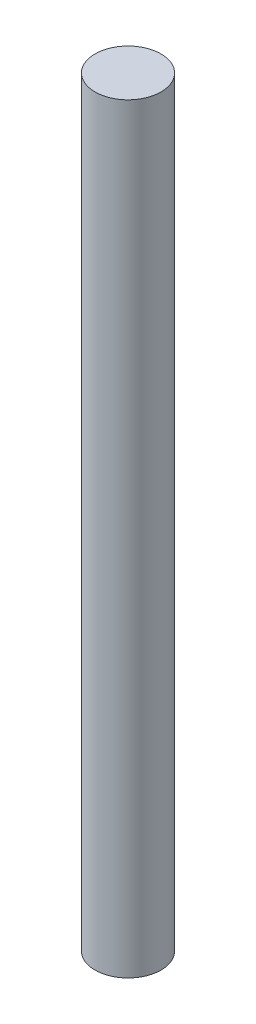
ISO-10303-21;
HEADER;
FILE_DESCRIPTION(('STEP AP214'),'2;1');
FILE_NAME('part.step','',(''),(''),'','','');
FILE_SCHEMA(('AUTOMOTIVE_DESIGN { 1 0 10303 214 1 1 1 1 }'));
ENDSEC;
DATA;
#1=APPLICATION_CONTEXT('core data for automotive mechanical design processes');
#2=APPLICATION_PROTOCOL_DEFINITION('international standard','automotive_design',2000,#1);
#3=PRODUCT_CONTEXT('',#1,'mechanical');
#4=PRODUCT('Part','Part','',(#3));
#5=PRODUCT_RELATED_PRODUCT_CATEGORY('part','',(#4));
#6=PRODUCT_DEFINITION_FORMATION('','',#4);
#7=PRODUCT_DEFINITION_CONTEXT('part definition',#1,'design');
#8=PRODUCT_DEFINITION('design','',#6,#7);
#9=PRODUCT_DEFINITION_SHAPE('','',#8);
#10=(LENGTH_UNIT() NAMED_UNIT(*) SI_UNIT(.MILLI.,.METRE.));
#11=(NAMED_UNIT(*) PLANE_ANGLE_UNIT() SI_UNIT($,.RADIAN.));
#12=(NAMED_UNIT(*) SI_UNIT($,.STERADIAN.) SOLID_ANGLE_UNIT());
#13=UNCERTAINTY_MEASURE_WITH_UNIT(LENGTH_MEASURE(1.E-05),#10,'distance_accuracy_value','');
#14=(GEOMETRIC_REPRESENTATION_CONTEXT(3) GLOBAL_UNCERTAINTY_ASSIGNED_CONTEXT((#13)) GLOBAL_UNIT_ASSIGNED_CONTEXT((#10,
#11,#12)) REPRESENTATION_CONTEXT('',''));
#15=CARTESIAN_POINT('',(0.,0.,0.));
#16=DIRECTION('',(0.,0.,1.));
#17=DIRECTION('',(1.,0.,0.));
#18=AXIS2_PLACEMENT_3D('',#15,#16,#17);
#19=CARTESIAN_POINT('',(9.,10.,0.));
#20=DIRECTION('',(0.,1.,0.));
#21=DIRECTION('',(1.,0.,0.));
#22=AXIS2_PLACEMENT_3D('',#19,#20,#21);
#23=PLANE('',#22);
#24=CARTESIAN_POINT('',(9.,10.,0.));
#25=DIRECTION('',(0.,-1.,0.));
#26=DIRECTION('',(-1.,0.,0.));
#27=AXIS2_PLACEMENT_3D('',#24,#25,#26);
#28=CIRCLE('',#27,1.5);
#29=CARTESIAN_POINT('',(10.5,10.,0.));
#30=VERTEX_POINT('',#29);
#31=EDGE_CURVE('E11',#30,#30,#28,.T.);
#32=ORIENTED_EDGE('',*,*,#31,.T.);
#33=EDGE_LOOP('',(#32));
#34=FACE_BOUND('',#33,.T.);
#35=ADVANCED_FACE('F16',(#34),#23,.F.);
#36=CARTESIAN_POINT('',(9.,44.6,0.));
#37=DIRECTION('',(0.,1.,0.));
#38=DIRECTION('',(1.,0.,0.));
#39=AXIS2_PLACEMENT_3D('',#36,#37,#38);
#40=PLANE('',#39);
#41=CARTESIAN_POINT('',(9.,44.6,0.));
#42=DIRECTION('',(0.,-1.,0.));
#43=DIRECTION('',(-1.,0.,0.));
#44=AXIS2_PLACEMENT_3D('',#41,#42,#43);
#45=CIRCLE('',#44,1.5);
#46=CARTESIAN_POINT('',(10.5,44.6,0.));
#47=VERTEX_POINT('',#46);
#48=EDGE_CURVE('E19',#47,#47,#45,.T.);
#49=ORIENTED_EDGE('',*,*,#48,.F.);
#50=EDGE_LOOP('',(#49));
#51=FACE_BOUND('',#50,.T.);
#52=ADVANCED_FACE('F41',(#51),#40,.T.);
#53=CARTESIAN_POINT('',(9.,36.3,0.));
#54=DIRECTION('',(0.,1.,0.));
#55=DIRECTION('',(-1.,0.,0.));
#56=AXIS2_PLACEMENT_3D('',#53,#54,#55);
#57=CYLINDRICAL_SURFACE('',#56,1.5);
#58=ORIENTED_EDGE('',*,*,#48,.T.);
#59=DIRECTION('',(0.,-1.,0.));
#60=VECTOR('',#59,1.);
#61=CARTESIAN_POINT('',(10.5,36.3,0.));
#62=LINE('',#61,#60);
#63=EDGE_CURVE('E43',#47,#30,#62,.T.);
#64=ORIENTED_EDGE('',*,*,#63,.T.);
#65=ORIENTED_EDGE('',*,*,#31,.F.);
#66=ORIENTED_EDGE('',*,*,#63,.F.);
#67=EDGE_LOOP('',(#58,#64,#65,#66));
#68=FACE_BOUND('',#67,.T.);
#69=ADVANCED_FACE('F50',(#68),#57,.T.);
#70=CLOSED_SHELL('',(#35,#52,#69));
#71=MANIFOLD_SOLID_BREP('B1',#70);
#72=ADVANCED_BREP_SHAPE_REPRESENTATION('',(#18,#71),#14);
#73=SHAPE_DEFINITION_REPRESENTATION(#9,#72);
ENDSEC;
END-ISO-10303-21;
